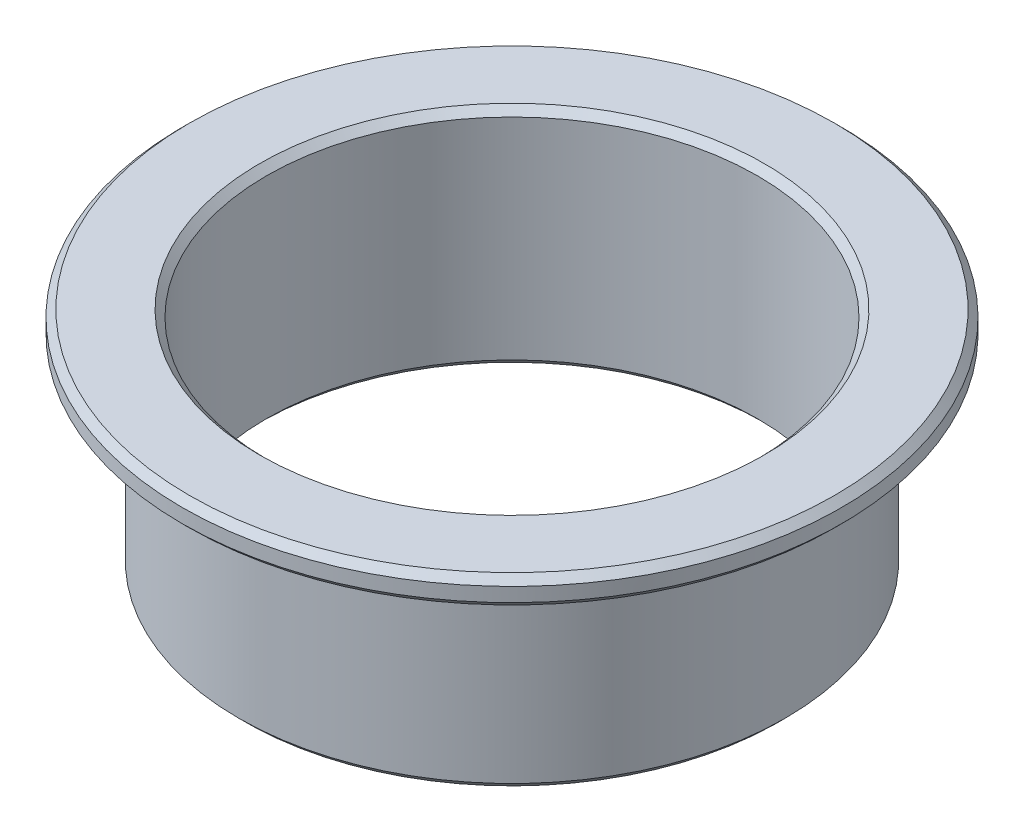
from build123d import *

# Parameters (mm, degrees)
CONG_1_R        = 1
CHANFREIN1_SIZE = 0.5


with BuildPart() as part:
    # Esquisse1 → R_volution1 (revolve)
    with BuildSketch(Plane.XY, mode=Mode.PRIVATE) as r_volution1_sk:
        Polygon((-17.5, -7.751314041), (-19.5, -7.751314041), (-19.5, 6.248685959), (-23.5, 6.248685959), (-23.5, 8.248685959), (-17.5, 8.248685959), align=None)
    revolve(r_volution1_sk.sketch.rotate(Axis((0, 32.828493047, 0), (0, -1, 0)), 270), axis=Axis((0, 32.828493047, 0), (0, -1, 0)))

    # Cong_1
    cong_1_edges = [part.edges().sort_by_distance(p)[0] for p in [
        (0, 6.248685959, -19.5),
    ]]
    fillet(cong_1_edges, radius=CONG_1_R)

    # Chanfrein1
    chanfrein1_edges = [part.edges().sort_by_distance(p)[0] for p in [
        (0, -7.751314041, -17.5),
        (0, -7.751314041, -19.5),
        (0, 6.248685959, -23.5),
        (0, 8.248685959, -23.5),
        (0, 8.248685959, -17.5),
    ]]
    chamfer(chanfrein1_edges, length=CHANFREIN1_SIZE)


solid = part.part
